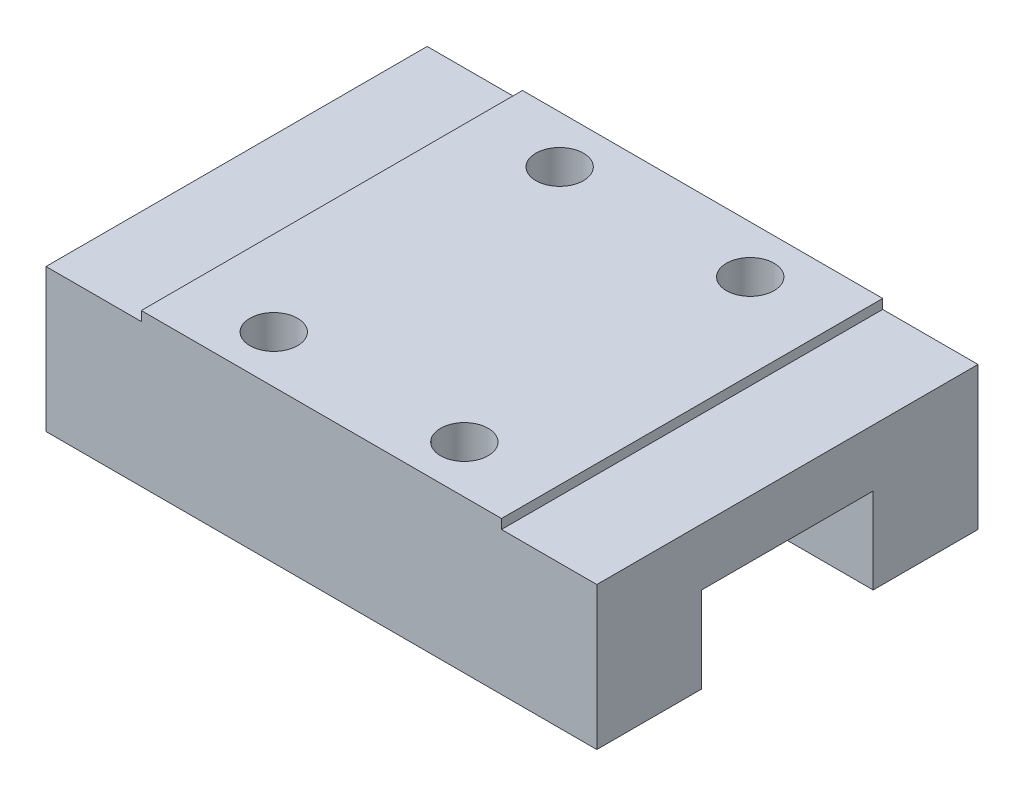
from build123d import *

# Parameters (mm, degrees)
EXTRUDE_1_DEPTH     = 20
SKETCH_2_W          = 9
SKETCH_2_H          = 6.5
CUT_EXTRUDE_1_DEPTH = 37.044555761
SKETCH_3_R          = 1.25
CUT_EXTRUDE_2_DEPTH = 10


with BuildPart() as part:
    # Sketch 1 → Extrude 1 (new body)
    with BuildSketch(Plane.XY):
        Polygon((23.9, 7.5), (28.9, 7.5), (28.9, 0), (0, 0), (0, 7.5), (5, 7.5), (5, 8), (23.9, 8), align=None)
    extrude(amount=EXTRUDE_1_DEPTH)

    # Sketch 2 → Cut-Extrude 1 (cut, through all)
    with BuildSketch(Plane(origin=(28.9, 0, 0), x_dir=(0, 0, -1), z_dir=(1, 0, 0))):
        with Locations((-10, 1.25)):
            Rectangle(SKETCH_2_W, SKETCH_2_H)
    extrude(amount=-CUT_EXTRUDE_1_DEPTH, mode=Mode.SUBTRACT)

    # Sketch 3 → Cut-Extrude 2 (cut)
    with BuildSketch(Plane(origin=(0, 8, 0), x_dir=(1, 0, 0), z_dir=(0, 1, 0))):
        with Locations(Location((9.45, -2.5, 0), (0, 0, 270))):
            Circle(SKETCH_3_R)
        with Locations(Location((9.45, -17.5, 0), (0, 0, 270))):
            Circle(SKETCH_3_R)
        with Locations(Location((19.45, -17.5, 0), (0, 0, 270))):
            Circle(SKETCH_3_R)
        with Locations(Location((19.45, -2.5, 0), (0, 0, 270))):
            Circle(SKETCH_3_R)
    extrude(amount=-CUT_EXTRUDE_2_DEPTH, mode=Mode.SUBTRACT)


solid = part.part
